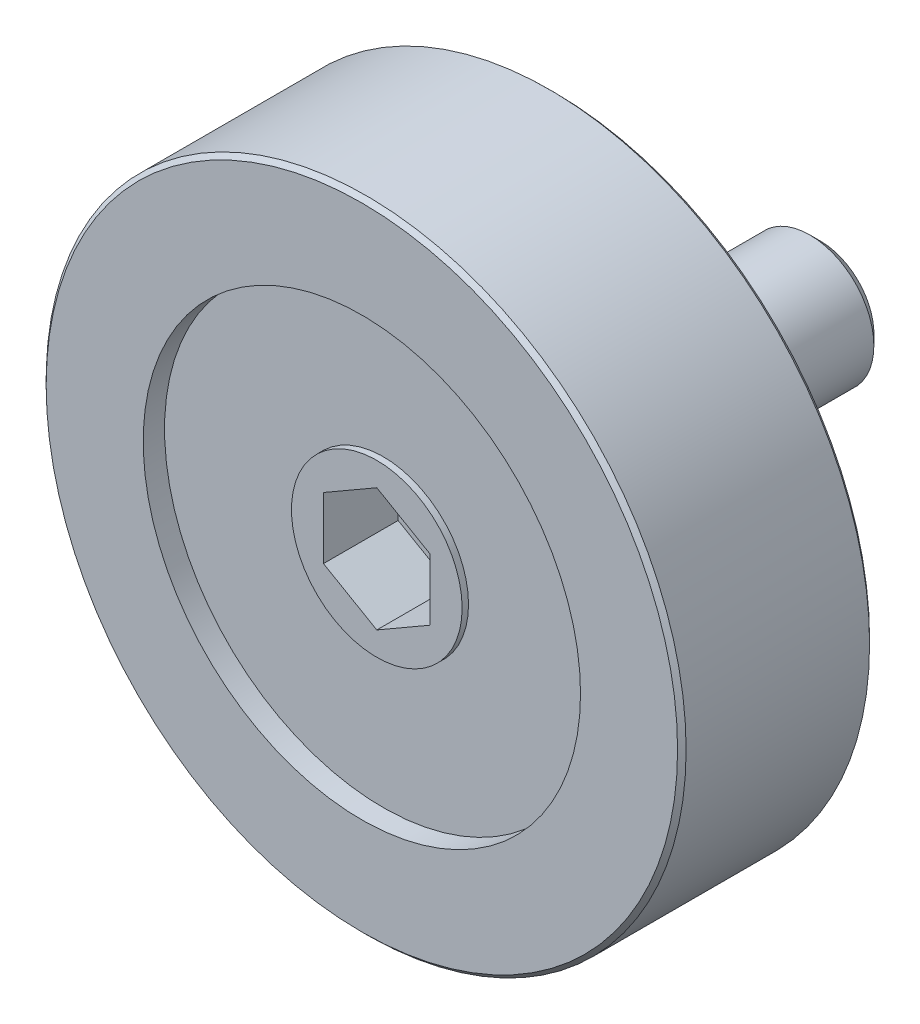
ISO-10303-21;
HEADER;
FILE_DESCRIPTION(('STEP AP214'),'2;1');
FILE_NAME('part.step','',(''),(''),'','','');
FILE_SCHEMA(('AUTOMOTIVE_DESIGN { 1 0 10303 214 1 1 1 1 }'));
ENDSEC;
DATA;
#1=APPLICATION_CONTEXT('core data for automotive mechanical design processes');
#2=APPLICATION_PROTOCOL_DEFINITION('international standard','automotive_design',2000,#1);
#3=PRODUCT_CONTEXT('',#1,'mechanical');
#4=PRODUCT('Part','Part','',(#3));
#5=PRODUCT_RELATED_PRODUCT_CATEGORY('part','',(#4));
#6=PRODUCT_DEFINITION_FORMATION('','',#4);
#7=PRODUCT_DEFINITION_CONTEXT('part definition',#1,'design');
#8=PRODUCT_DEFINITION('design','',#6,#7);
#9=PRODUCT_DEFINITION_SHAPE('','',#8);
#10=(LENGTH_UNIT() NAMED_UNIT(*) SI_UNIT(.MILLI.,.METRE.));
#11=(NAMED_UNIT(*) PLANE_ANGLE_UNIT() SI_UNIT($,.RADIAN.));
#12=(NAMED_UNIT(*) SI_UNIT($,.STERADIAN.) SOLID_ANGLE_UNIT());
#13=UNCERTAINTY_MEASURE_WITH_UNIT(LENGTH_MEASURE(1.E-05),#10,'distance_accuracy_value','');
#14=(GEOMETRIC_REPRESENTATION_CONTEXT(3) GLOBAL_UNCERTAINTY_ASSIGNED_CONTEXT((#13)) GLOBAL_UNIT_ASSIGNED_CONTEXT((#10,
#11,#12)) REPRESENTATION_CONTEXT('',''));
#15=CARTESIAN_POINT('',(0.,0.,0.));
#16=DIRECTION('',(0.,0.,1.));
#17=DIRECTION('',(1.,0.,0.));
#18=AXIS2_PLACEMENT_3D('',#15,#16,#17);
#19=CARTESIAN_POINT('',(0.,0.,0.5));
#20=DIRECTION('',(0.,0.,-1.));
#21=DIRECTION('',(-1.,0.,0.));
#22=AXIS2_PLACEMENT_3D('',#19,#20,#21);
#23=PLANE('',#22);
#24=CARTESIAN_POINT('',(0.,0.,0.5));
#25=DIRECTION('',(0.,0.,-1.));
#26=DIRECTION('',(-1.,0.,0.));
#27=AXIS2_PLACEMENT_3D('',#24,#25,#26);
#28=CIRCLE('',#27,2.35);
#29=CARTESIAN_POINT('',(-2.35,0.,0.5));
#30=VERTEX_POINT('',#29);
#31=EDGE_CURVE('E9',#30,#30,#28,.T.);
#32=ORIENTED_EDGE('',*,*,#31,.F.);
#33=EDGE_LOOP('',(#32));
#34=FACE_BOUND('',#33,.T.);
#35=CARTESIAN_POINT('',(0.,0.,0.5));
#36=DIRECTION('',(0.,0.,-1.));
#37=DIRECTION('',(-1.,0.,0.));
#38=AXIS2_PLACEMENT_3D('',#35,#36,#37);
#39=CIRCLE('',#38,5.1);
#40=CARTESIAN_POINT('',(-5.1,0.,0.5));
#41=VERTEX_POINT('',#40);
#42=EDGE_CURVE('E119',#41,#41,#39,.F.);
#43=ORIENTED_EDGE('',*,*,#42,.F.);
#44=EDGE_LOOP('',(#43));
#45=FACE_BOUND('',#44,.T.);
#46=ADVANCED_FACE('F14',(#34,#45),#23,.T.);
#47=CARTESIAN_POINT('',(0.,0.,5.8));
#48=DIRECTION('',(0.,0.,1.));
#49=DIRECTION('',(1.,0.,0.));
#50=AXIS2_PLACEMENT_3D('',#47,#48,#49);
#51=PLANE('',#50);
#52=DIRECTION('',(-0.866025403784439,0.5,0.));
#53=VECTOR('',#52,1.);
#54=CARTESIAN_POINT('',(2.5,1.44337567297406,5.8));
#55=LINE('',#54,#53);
#56=CARTESIAN_POINT('',(2.5,1.44337567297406,5.8));
#57=VERTEX_POINT('',#56);
#58=CARTESIAN_POINT('',(0.,2.88675134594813,5.8));
#59=VERTEX_POINT('',#58);
#60=EDGE_CURVE('E98',#57,#59,#55,.T.);
#61=ORIENTED_EDGE('',*,*,#60,.T.);
#62=DIRECTION('',(-0.866025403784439,-0.5,0.));
#63=VECTOR('',#62,1.);
#64=CARTESIAN_POINT('',(0.,2.88675134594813,5.8));
#65=LINE('',#64,#63);
#66=CARTESIAN_POINT('',(-2.5,1.44337567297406,5.8));
#67=VERTEX_POINT('',#66);
#68=EDGE_CURVE('E115',#59,#67,#65,.T.);
#69=ORIENTED_EDGE('',*,*,#68,.T.);
#70=DIRECTION('',(0.,-1.,0.));
#71=VECTOR('',#70,1.);
#72=CARTESIAN_POINT('',(-2.5,1.44337567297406,5.8));
#73=LINE('',#72,#71);
#74=CARTESIAN_POINT('',(-2.5,-1.44337567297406,5.8));
#75=VERTEX_POINT('',#74);
#76=EDGE_CURVE('E112',#67,#75,#73,.T.);
#77=ORIENTED_EDGE('',*,*,#76,.T.);
#78=DIRECTION('',(0.866025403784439,-0.5,0.));
#79=VECTOR('',#78,1.);
#80=CARTESIAN_POINT('',(-2.5,-1.44337567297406,5.8));
#81=LINE('',#80,#79);
#82=CARTESIAN_POINT('',(0.,-2.88675134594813,5.8));
#83=VERTEX_POINT('',#82);
#84=EDGE_CURVE('E110',#75,#83,#81,.T.);
#85=ORIENTED_EDGE('',*,*,#84,.T.);
#86=DIRECTION('',(0.866025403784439,0.5,0.));
#87=VECTOR('',#86,1.);
#88=CARTESIAN_POINT('',(0.,-2.88675134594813,5.8));
#89=LINE('',#88,#87);
#90=CARTESIAN_POINT('',(2.5,-1.44337567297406,5.8));
#91=VERTEX_POINT('',#90);
#92=EDGE_CURVE('E79',#83,#91,#89,.T.);
#93=ORIENTED_EDGE('',*,*,#92,.T.);
#94=DIRECTION('',(0.,1.,0.));
#95=VECTOR('',#94,1.);
#96=CARTESIAN_POINT('',(2.5,-1.44337567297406,5.8));
#97=LINE('',#96,#95);
#98=EDGE_CURVE('E106',#91,#57,#97,.T.);
#99=ORIENTED_EDGE('',*,*,#98,.T.);
#100=EDGE_LOOP('',(#61,#69,#77,#85,#93,#99));
#101=FACE_BOUND('',#100,.T.);
#102=ADVANCED_FACE('F174',(#101),#51,.T.);
#103=CARTESIAN_POINT('',(0.,2.88675134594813,5.8));
#104=DIRECTION('',(-0.5,0.866025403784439,0.));
#105=DIRECTION('',(-0.866025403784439,-0.5,0.));
#106=AXIS2_PLACEMENT_3D('',#103,#104,#105);
#107=PLANE('',#106);
#108=DIRECTION('',(-0.866025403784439,-0.5,0.));
#109=VECTOR('',#108,1.);
#110=CARTESIAN_POINT('',(0.,2.88675134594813,9.3));
#111=LINE('',#110,#109);
#112=CARTESIAN_POINT('',(0.,2.88675134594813,9.3));
#113=VERTEX_POINT('',#112);
#114=CARTESIAN_POINT('',(-2.5,1.44337567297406,9.3));
#115=VERTEX_POINT('',#114);
#116=EDGE_CURVE('E103',#113,#115,#111,.T.);
#117=ORIENTED_EDGE('',*,*,#116,.T.);
#118=DIRECTION('',(0.,0.,1.));
#119=VECTOR('',#118,1.);
#120=CARTESIAN_POINT('',(-2.5,1.44337567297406,5.8));
#121=LINE('',#120,#119);
#122=EDGE_CURVE('E31',#67,#115,#121,.T.);
#123=ORIENTED_EDGE('',*,*,#122,.F.);
#124=ORIENTED_EDGE('',*,*,#68,.F.);
#125=DIRECTION('',(0.,0.,1.));
#126=VECTOR('',#125,1.);
#127=CARTESIAN_POINT('',(0.,2.88675134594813,5.8));
#128=LINE('',#127,#126);
#129=EDGE_CURVE('E59',#59,#113,#128,.T.);
#130=ORIENTED_EDGE('',*,*,#129,.T.);
#131=EDGE_LOOP('',(#117,#123,#124,#130));
#132=FACE_BOUND('',#131,.T.);
#133=ADVANCED_FACE('F177',(#132),#107,.F.);
#134=CARTESIAN_POINT('',(-2.5,1.44337567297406,5.8));
#135=DIRECTION('',(-1.,0.,0.));
#136=DIRECTION('',(0.,-1.,0.));
#137=AXIS2_PLACEMENT_3D('',#134,#135,#136);
#138=PLANE('',#137);
#139=DIRECTION('',(0.,-1.,0.));
#140=VECTOR('',#139,1.);
#141=CARTESIAN_POINT('',(-2.5,1.44337567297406,9.3));
#142=LINE('',#141,#140);
#143=CARTESIAN_POINT('',(-2.5,-1.44337567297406,9.3));
#144=VERTEX_POINT('',#143);
#145=EDGE_CURVE('E91',#115,#144,#142,.T.);
#146=ORIENTED_EDGE('',*,*,#145,.T.);
#147=DIRECTION('',(0.,0.,1.));
#148=VECTOR('',#147,1.);
#149=CARTESIAN_POINT('',(-2.5,-1.44337567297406,5.8));
#150=LINE('',#149,#148);
#151=EDGE_CURVE('E83',#75,#144,#150,.T.);
#152=ORIENTED_EDGE('',*,*,#151,.F.);
#153=ORIENTED_EDGE('',*,*,#76,.F.);
#154=ORIENTED_EDGE('',*,*,#122,.T.);
#155=EDGE_LOOP('',(#146,#152,#153,#154));
#156=FACE_BOUND('',#155,.T.);
#157=ADVANCED_FACE('F175',(#156),#138,.F.);
#158=CARTESIAN_POINT('',(-2.5,-1.44337567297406,5.8));
#159=DIRECTION('',(-0.5,-0.866025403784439,0.));
#160=DIRECTION('',(0.866025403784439,-0.5,0.));
#161=AXIS2_PLACEMENT_3D('',#158,#159,#160);
#162=PLANE('',#161);
#163=DIRECTION('',(0.866025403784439,-0.5,0.));
#164=VECTOR('',#163,1.);
#165=CARTESIAN_POINT('',(-2.5,-1.44337567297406,9.3));
#166=LINE('',#165,#164);
#167=CARTESIAN_POINT('',(0.,-2.88675134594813,9.3));
#168=VERTEX_POINT('',#167);
#169=EDGE_CURVE('E87',#144,#168,#166,.T.);
#170=ORIENTED_EDGE('',*,*,#169,.T.);
#171=DIRECTION('',(0.,0.,1.));
#172=VECTOR('',#171,1.);
#173=CARTESIAN_POINT('',(0.,-2.88675134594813,5.8));
#174=LINE('',#173,#172);
#175=EDGE_CURVE('E72',#83,#168,#174,.T.);
#176=ORIENTED_EDGE('',*,*,#175,.F.);
#177=ORIENTED_EDGE('',*,*,#84,.F.);
#178=ORIENTED_EDGE('',*,*,#151,.T.);
#179=EDGE_LOOP('',(#170,#176,#177,#178));
#180=FACE_BOUND('',#179,.T.);
#181=ADVANCED_FACE('F88',(#180),#162,.F.);
#182=CARTESIAN_POINT('',(0.,-2.88675134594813,5.8));
#183=DIRECTION('',(0.5,-0.866025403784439,0.));
#184=DIRECTION('',(0.866025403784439,0.5,0.));
#185=AXIS2_PLACEMENT_3D('',#182,#183,#184);
#186=PLANE('',#185);
#187=DIRECTION('',(0.866025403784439,0.5,0.));
#188=VECTOR('',#187,1.);
#189=CARTESIAN_POINT('',(0.,-2.88675134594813,9.3));
#190=LINE('',#189,#188);
#191=CARTESIAN_POINT('',(2.5,-1.44337567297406,9.3));
#192=VERTEX_POINT('',#191);
#193=EDGE_CURVE('E76',#168,#192,#190,.T.);
#194=ORIENTED_EDGE('',*,*,#193,.T.);
#195=DIRECTION('',(0.,0.,1.));
#196=VECTOR('',#195,1.);
#197=CARTESIAN_POINT('',(2.5,-1.44337567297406,5.8));
#198=LINE('',#197,#196);
#199=EDGE_CURVE('E84',#91,#192,#198,.T.);
#200=ORIENTED_EDGE('',*,*,#199,.F.);
#201=ORIENTED_EDGE('',*,*,#92,.F.);
#202=ORIENTED_EDGE('',*,*,#175,.T.);
#203=EDGE_LOOP('',(#194,#200,#201,#202));
#204=FACE_BOUND('',#203,.T.);
#205=ADVANCED_FACE('F74',(#204),#186,.F.);
#206=CARTESIAN_POINT('',(2.5,-1.44337567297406,5.8));
#207=DIRECTION('',(1.,0.,0.));
#208=DIRECTION('',(0.,0.,-1.));
#209=AXIS2_PLACEMENT_3D('',#206,#207,#208);
#210=PLANE('',#209);
#211=DIRECTION('',(0.,1.,0.));
#212=VECTOR('',#211,1.);
#213=CARTESIAN_POINT('',(2.5,-1.44337567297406,9.3));
#214=LINE('',#213,#212);
#215=CARTESIAN_POINT('',(2.5,1.44337567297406,9.3));
#216=VERTEX_POINT('',#215);
#217=EDGE_CURVE('E96',#192,#216,#214,.T.);
#218=ORIENTED_EDGE('',*,*,#217,.T.);
#219=DIRECTION('',(0.,0.,1.));
#220=VECTOR('',#219,1.);
#221=CARTESIAN_POINT('',(2.5,1.44337567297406,5.8));
#222=LINE('',#221,#220);
#223=EDGE_CURVE('E63',#57,#216,#222,.T.);
#224=ORIENTED_EDGE('',*,*,#223,.F.);
#225=ORIENTED_EDGE('',*,*,#98,.F.);
#226=ORIENTED_EDGE('',*,*,#199,.T.);
#227=EDGE_LOOP('',(#218,#224,#225,#226));
#228=FACE_BOUND('',#227,.T.);
#229=ADVANCED_FACE('F172',(#228),#210,.F.);
#230=CARTESIAN_POINT('',(2.5,1.44337567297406,5.8));
#231=DIRECTION('',(0.5,0.866025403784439,0.));
#232=DIRECTION('',(-0.866025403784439,0.5,0.));
#233=AXIS2_PLACEMENT_3D('',#230,#231,#232);
#234=PLANE('',#233);
#235=DIRECTION('',(-0.866025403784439,0.5,0.));
#236=VECTOR('',#235,1.);
#237=CARTESIAN_POINT('',(2.5,1.44337567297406,9.3));
#238=LINE('',#237,#236);
#239=EDGE_CURVE('E23',#216,#113,#238,.T.);
#240=ORIENTED_EDGE('',*,*,#239,.T.);
#241=ORIENTED_EDGE('',*,*,#129,.F.);
#242=ORIENTED_EDGE('',*,*,#60,.F.);
#243=ORIENTED_EDGE('',*,*,#223,.T.);
#244=EDGE_LOOP('',(#240,#241,#242,#243));
#245=FACE_BOUND('',#244,.T.);
#246=ADVANCED_FACE('F178',(#245),#234,.F.);
#247=CARTESIAN_POINT('',(0.,4.00000000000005,9.3));
#248=DIRECTION('',(0.,0.,1.));
#249=DIRECTION('',(1.,0.,0.));
#250=AXIS2_PLACEMENT_3D('',#247,#248,#249);
#251=PLANE('',#250);
#252=ORIENTED_EDGE('',*,*,#239,.F.);
#253=ORIENTED_EDGE('',*,*,#217,.F.);
#254=ORIENTED_EDGE('',*,*,#193,.F.);
#255=ORIENTED_EDGE('',*,*,#169,.F.);
#256=ORIENTED_EDGE('',*,*,#145,.F.);
#257=ORIENTED_EDGE('',*,*,#116,.F.);
#258=EDGE_LOOP('',(#252,#253,#254,#255,#256,#257));
#259=FACE_BOUND('',#258,.T.);
#260=CARTESIAN_POINT('',(0.,0.,9.3));
#261=DIRECTION('',(0.,0.,1.));
#262=DIRECTION('',(1.,0.,0.));
#263=AXIS2_PLACEMENT_3D('',#260,#261,#262);
#264=CIRCLE('',#263,4.00000000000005);
#265=CARTESIAN_POINT('',(4.00000000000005,0.,9.3));
#266=VERTEX_POINT('',#265);
#267=EDGE_CURVE('E155',#266,#266,#264,.T.);
#268=ORIENTED_EDGE('',*,*,#267,.T.);
#269=EDGE_LOOP('',(#268));
#270=FACE_BOUND('',#269,.T.);
#271=ADVANCED_FACE('F94',(#259,#270),#251,.T.);
#272=CARTESIAN_POINT('',(0.,0.,13.));
#273=DIRECTION('',(0.,0.,1.));
#274=DIRECTION('',(1.,0.,0.));
#275=AXIS2_PLACEMENT_3D('',#272,#273,#274);
#276=CYLINDRICAL_SURFACE('',#275,4.00000000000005);
#277=CARTESIAN_POINT('',(0.,0.,9.));
#278=DIRECTION('',(0.,0.,1.));
#279=DIRECTION('',(1.,0.,0.));
#280=AXIS2_PLACEMENT_3D('',#277,#278,#279);
#281=CIRCLE('',#280,4.00000000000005);
#282=CARTESIAN_POINT('',(4.00000000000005,0.,9.));
#283=VERTEX_POINT('',#282);
#284=EDGE_CURVE('E158',#283,#283,#281,.T.);
#285=ORIENTED_EDGE('',*,*,#284,.T.);
#286=EDGE_LOOP('',(#285));
#287=FACE_BOUND('',#286,.T.);
#288=ORIENTED_EDGE('',*,*,#267,.F.);
#289=EDGE_LOOP('',(#288));
#290=FACE_BOUND('',#289,.T.);
#291=ADVANCED_FACE('F186',(#287,#290),#276,.T.);
#292=CARTESIAN_POINT('',(0.,10.25,9.));
#293=DIRECTION('',(0.,0.,1.));
#294=DIRECTION('',(1.,0.,0.));
#295=AXIS2_PLACEMENT_3D('',#292,#293,#294);
#296=PLANE('',#295);
#297=CARTESIAN_POINT('',(0.,0.,9.));
#298=DIRECTION('',(0.,0.,1.));
#299=DIRECTION('',(1.,0.,0.));
#300=AXIS2_PLACEMENT_3D('',#297,#298,#299);
#301=CIRCLE('',#300,10.25);
#302=CARTESIAN_POINT('',(10.25,0.,9.));
#303=VERTEX_POINT('',#302);
#304=EDGE_CURVE('E161',#303,#303,#301,.T.);
#305=ORIENTED_EDGE('',*,*,#304,.T.);
#306=EDGE_LOOP('',(#305));
#307=FACE_BOUND('',#306,.T.);
#308=ORIENTED_EDGE('',*,*,#284,.F.);
#309=EDGE_LOOP('',(#308));
#310=FACE_BOUND('',#309,.T.);
#311=ADVANCED_FACE('F250',(#307,#310),#296,.T.);
#312=CARTESIAN_POINT('',(0.,0.,13.));
#313=DIRECTION('',(0.,0.,1.));
#314=DIRECTION('',(1.,0.,0.));
#315=AXIS2_PLACEMENT_3D('',#312,#313,#314);
#316=CYLINDRICAL_SURFACE('',#315,10.25);
#317=CARTESIAN_POINT('',(0.,0.,10.));
#318=DIRECTION('',(0.,0.,1.));
#319=DIRECTION('',(1.,0.,0.));
#320=AXIS2_PLACEMENT_3D('',#317,#318,#319);
#321=CIRCLE('',#320,10.25);
#322=CARTESIAN_POINT('',(10.25,0.,10.));
#323=VERTEX_POINT('',#322);
#324=EDGE_CURVE('E164',#323,#323,#321,.T.);
#325=ORIENTED_EDGE('',*,*,#324,.T.);
#326=EDGE_LOOP('',(#325));
#327=FACE_BOUND('',#326,.T.);
#328=ORIENTED_EDGE('',*,*,#304,.F.);
#329=EDGE_LOOP('',(#328));
#330=FACE_BOUND('',#329,.T.);
#331=ADVANCED_FACE('F261',(#327,#330),#316,.F.);
#332=CARTESIAN_POINT('',(0.,14.8,10.));
#333=DIRECTION('',(0.,0.,1.));
#334=DIRECTION('',(1.,0.,0.));
#335=AXIS2_PLACEMENT_3D('',#332,#333,#334);
#336=PLANE('',#335);
#337=CARTESIAN_POINT('',(0.,0.,9.99999999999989));
#338=DIRECTION('',(0.,0.,1.));
#339=DIRECTION('',(1.,0.,0.));
#340=AXIS2_PLACEMENT_3D('',#337,#338,#339);
#341=CIRCLE('',#340,14.8);
#342=CARTESIAN_POINT('',(14.8,0.,9.99999999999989));
#343=VERTEX_POINT('',#342);
#344=EDGE_CURVE('E121',#343,#343,#341,.T.);
#345=ORIENTED_EDGE('',*,*,#344,.T.);
#346=EDGE_LOOP('',(#345));
#347=FACE_BOUND('',#346,.T.);
#348=ORIENTED_EDGE('',*,*,#324,.F.);
#349=EDGE_LOOP('',(#348));
#350=FACE_BOUND('',#349,.T.);
#351=ADVANCED_FACE('F271',(#347,#350),#336,.T.);
#352=CARTESIAN_POINT('',(0.,0.,9.99999999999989));
#353=DIRECTION('',(0.,0.,-1.));
#354=DIRECTION('',(-1.,0.,0.));
#355=AXIS2_PLACEMENT_3D('',#352,#353,#354);
#356=CONICAL_SURFACE('',#355,14.8,0.785398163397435);
#357=CARTESIAN_POINT('',(0.,0.,9.79999999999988));
#358=DIRECTION('',(0.,0.,1.));
#359=DIRECTION('',(1.,0.,0.));
#360=AXIS2_PLACEMENT_3D('',#357,#358,#359);
#361=CIRCLE('',#360,15.);
#362=CARTESIAN_POINT('',(15.,0.,9.79999999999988));
#363=VERTEX_POINT('',#362);
#364=EDGE_CURVE('E126',#363,#363,#361,.T.);
#365=ORIENTED_EDGE('',*,*,#364,.T.);
#366=EDGE_LOOP('',(#365));
#367=FACE_BOUND('',#366,.T.);
#368=ORIENTED_EDGE('',*,*,#344,.F.);
#369=EDGE_LOOP('',(#368));
#370=FACE_BOUND('',#369,.T.);
#371=ADVANCED_FACE('F280',(#367,#370),#356,.T.);
#372=CARTESIAN_POINT('',(0.,0.,13.));
#373=DIRECTION('',(0.,0.,1.));
#374=DIRECTION('',(1.,0.,0.));
#375=AXIS2_PLACEMENT_3D('',#372,#373,#374);
#376=CYLINDRICAL_SURFACE('',#375,15.);
#377=CARTESIAN_POINT('',(0.,0.,1.2));
#378=DIRECTION('',(0.,0.,1.));
#379=DIRECTION('',(1.,0.,0.));
#380=AXIS2_PLACEMENT_3D('',#377,#378,#379);
#381=CIRCLE('',#380,15.);
#382=CARTESIAN_POINT('',(15.,0.,1.2));
#383=VERTEX_POINT('',#382);
#384=EDGE_CURVE('E140',#383,#383,#381,.T.);
#385=ORIENTED_EDGE('',*,*,#384,.T.);
#386=EDGE_LOOP('',(#385));
#387=FACE_BOUND('',#386,.T.);
#388=ORIENTED_EDGE('',*,*,#364,.F.);
#389=EDGE_LOOP('',(#388));
#390=FACE_BOUND('',#389,.T.);
#391=ADVANCED_FACE('F290',(#387,#390),#376,.T.);
#392=CARTESIAN_POINT('',(0.,0.,1.2));
#393=DIRECTION('',(0.,0.,1.));
#394=DIRECTION('',(1.,0.,0.));
#395=AXIS2_PLACEMENT_3D('',#392,#393,#394);
#396=CONICAL_SURFACE('',#395,15.,0.785398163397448);
#397=CARTESIAN_POINT('',(0.,0.,1.));
#398=DIRECTION('',(0.,0.,1.));
#399=DIRECTION('',(1.,0.,0.));
#400=AXIS2_PLACEMENT_3D('',#397,#398,#399);
#401=CIRCLE('',#400,14.8);
#402=CARTESIAN_POINT('',(14.8,0.,1.));
#403=VERTEX_POINT('',#402);
#404=EDGE_CURVE('E143',#403,#403,#401,.T.);
#405=ORIENTED_EDGE('',*,*,#404,.T.);
#406=EDGE_LOOP('',(#405));
#407=FACE_BOUND('',#406,.T.);
#408=ORIENTED_EDGE('',*,*,#384,.F.);
#409=EDGE_LOOP('',(#408));
#410=FACE_BOUND('',#409,.T.);
#411=ADVANCED_FACE('F300',(#407,#410),#396,.T.);
#412=CARTESIAN_POINT('',(0.,14.8,1.));
#413=DIRECTION('',(0.,0.,-1.));
#414=DIRECTION('',(-1.,0.,0.));
#415=AXIS2_PLACEMENT_3D('',#412,#413,#414);
#416=PLANE('',#415);
#417=CARTESIAN_POINT('',(0.,0.,1.));
#418=DIRECTION('',(0.,0.,1.));
#419=DIRECTION('',(1.,0.,0.));
#420=AXIS2_PLACEMENT_3D('',#417,#418,#419);
#421=CIRCLE('',#420,10.25);
#422=CARTESIAN_POINT('',(10.25,0.,1.));
#423=VERTEX_POINT('',#422);
#424=EDGE_CURVE('E146',#423,#423,#421,.T.);
#425=ORIENTED_EDGE('',*,*,#424,.T.);
#426=EDGE_LOOP('',(#425));
#427=FACE_BOUND('',#426,.T.);
#428=ORIENTED_EDGE('',*,*,#404,.F.);
#429=EDGE_LOOP('',(#428));
#430=FACE_BOUND('',#429,.T.);
#431=ADVANCED_FACE('F310',(#427,#430),#416,.T.);
#432=CARTESIAN_POINT('',(0.,0.,13.));
#433=DIRECTION('',(0.,0.,1.));
#434=DIRECTION('',(1.,0.,0.));
#435=AXIS2_PLACEMENT_3D('',#432,#433,#434);
#436=CYLINDRICAL_SURFACE('',#435,10.25);
#437=CARTESIAN_POINT('',(0.,0.,2.));
#438=DIRECTION('',(0.,0.,1.));
#439=DIRECTION('',(1.,0.,0.));
#440=AXIS2_PLACEMENT_3D('',#437,#438,#439);
#441=CIRCLE('',#440,10.25);
#442=CARTESIAN_POINT('',(10.25,0.,2.));
#443=VERTEX_POINT('',#442);
#444=EDGE_CURVE('E149',#443,#443,#441,.T.);
#445=ORIENTED_EDGE('',*,*,#444,.T.);
#446=EDGE_LOOP('',(#445));
#447=FACE_BOUND('',#446,.T.);
#448=ORIENTED_EDGE('',*,*,#424,.F.);
#449=EDGE_LOOP('',(#448));
#450=FACE_BOUND('',#449,.T.);
#451=ADVANCED_FACE('F320',(#447,#450),#436,.F.);
#452=CARTESIAN_POINT('',(0.,5.1,2.));
#453=DIRECTION('',(0.,0.,-1.));
#454=DIRECTION('',(-1.,0.,0.));
#455=AXIS2_PLACEMENT_3D('',#452,#453,#454);
#456=PLANE('',#455);
#457=CARTESIAN_POINT('',(0.,0.,2.));
#458=DIRECTION('',(0.,0.,1.));
#459=DIRECTION('',(1.,0.,0.));
#460=AXIS2_PLACEMENT_3D('',#457,#458,#459);
#461=CIRCLE('',#460,5.1);
#462=CARTESIAN_POINT('',(5.1,0.,2.));
#463=VERTEX_POINT('',#462);
#464=EDGE_CURVE('E152',#463,#463,#461,.T.);
#465=ORIENTED_EDGE('',*,*,#464,.T.);
#466=EDGE_LOOP('',(#465));
#467=FACE_BOUND('',#466,.T.);
#468=ORIENTED_EDGE('',*,*,#444,.F.);
#469=EDGE_LOOP('',(#468));
#470=FACE_BOUND('',#469,.T.);
#471=ADVANCED_FACE('F330',(#467,#470),#456,.T.);
#472=CARTESIAN_POINT('',(0.,0.,13.));
#473=DIRECTION('',(0.,0.,1.));
#474=DIRECTION('',(1.,0.,0.));
#475=AXIS2_PLACEMENT_3D('',#472,#473,#474);
#476=CYLINDRICAL_SURFACE('',#475,5.1);
#477=ORIENTED_EDGE('',*,*,#42,.T.);
#478=EDGE_LOOP('',(#477));
#479=FACE_BOUND('',#478,.T.);
#480=ORIENTED_EDGE('',*,*,#464,.F.);
#481=EDGE_LOOP('',(#480));
#482=FACE_BOUND('',#481,.T.);
#483=ADVANCED_FACE('F16',(#479,#482),#476,.T.);
#484=CARTESIAN_POINT('',(0.,0.,13.5));
#485=DIRECTION('',(0.,0.,1.));
#486=DIRECTION('',(1.,0.,0.));
#487=AXIS2_PLACEMENT_3D('',#484,#485,#486);
#488=CYLINDRICAL_SURFACE('',#487,2.35);
#489=CARTESIAN_POINT('',(0.,0.,-1.5));
#490=DIRECTION('',(0.,0.,1.));
#491=DIRECTION('',(1.,0.,0.));
#492=AXIS2_PLACEMENT_3D('',#489,#490,#491);
#493=CIRCLE('',#492,2.35);
#494=CARTESIAN_POINT('',(2.35,0.,-1.5));
#495=VERTEX_POINT('',#494);
#496=EDGE_CURVE('E134',#495,#495,#493,.T.);
#497=ORIENTED_EDGE('',*,*,#496,.T.);
#498=EDGE_LOOP('',(#497));
#499=FACE_BOUND('',#498,.T.);
#500=ORIENTED_EDGE('',*,*,#31,.T.);
#501=EDGE_LOOP('',(#500));
#502=FACE_BOUND('',#501,.T.);
#503=ADVANCED_FACE('F349',(#499,#502),#488,.T.);
#504=CARTESIAN_POINT('',(0.,2.35,-1.5));
#505=DIRECTION('',(0.,0.,1.));
#506=DIRECTION('',(1.,0.,0.));
#507=AXIS2_PLACEMENT_3D('',#504,#505,#506);
#508=PLANE('',#507);
#509=CARTESIAN_POINT('',(0.,0.,-1.5));
#510=DIRECTION('',(0.,0.,1.));
#511=DIRECTION('',(1.,0.,0.));
#512=AXIS2_PLACEMENT_3D('',#509,#510,#511);
#513=CIRCLE('',#512,3.);
#514=CARTESIAN_POINT('',(3.,0.,-1.5));
#515=VERTEX_POINT('',#514);
#516=EDGE_CURVE('E404',#515,#515,#513,.T.);
#517=ORIENTED_EDGE('',*,*,#516,.T.);
#518=EDGE_LOOP('',(#517));
#519=FACE_BOUND('',#518,.T.);
#520=ORIENTED_EDGE('',*,*,#496,.F.);
#521=EDGE_LOOP('',(#520));
#522=FACE_BOUND('',#521,.T.);
#523=ADVANCED_FACE('F356',(#519,#522),#508,.T.);
#524=CARTESIAN_POINT('',(0.,0.,13.5));
#525=DIRECTION('',(0.,0.,1.));
#526=DIRECTION('',(1.,0.,0.));
#527=AXIS2_PLACEMENT_3D('',#524,#525,#526);
#528=CYLINDRICAL_SURFACE('',#527,3.);
#529=CARTESIAN_POINT('',(0.,0.,-11.));
#530=DIRECTION('',(0.,0.,-1.));
#531=DIRECTION('',(-1.,0.,0.));
#532=AXIS2_PLACEMENT_3D('',#529,#530,#531);
#533=CIRCLE('',#532,3.);
#534=CARTESIAN_POINT('',(-3.,0.,-11.));
#535=VERTEX_POINT('',#534);
#536=EDGE_CURVE('E122',#535,#535,#533,.F.);
#537=ORIENTED_EDGE('',*,*,#536,.T.);
#538=EDGE_LOOP('',(#537));
#539=FACE_BOUND('',#538,.T.);
#540=ORIENTED_EDGE('',*,*,#516,.F.);
#541=EDGE_LOOP('',(#540));
#542=FACE_BOUND('',#541,.T.);
#543=ADVANCED_FACE('F366',(#539,#542),#528,.T.);
#544=CARTESIAN_POINT('',(0.,0.,-11.5));
#545=DIRECTION('',(0.,0.,-1.));
#546=DIRECTION('',(-1.,0.,0.));
#547=AXIS2_PLACEMENT_3D('',#544,#545,#546);
#548=PLANE('',#547);
#549=CARTESIAN_POINT('',(0.,0.,-11.5));
#550=DIRECTION('',(0.,0.,-1.));
#551=DIRECTION('',(-1.,0.,0.));
#552=AXIS2_PLACEMENT_3D('',#549,#550,#551);
#553=CIRCLE('',#552,2.5);
#554=CARTESIAN_POINT('',(-2.5,0.,-11.5));
#555=VERTEX_POINT('',#554);
#556=EDGE_CURVE('E129',#555,#555,#553,.T.);
#557=ORIENTED_EDGE('',*,*,#556,.T.);
#558=EDGE_LOOP('',(#557));
#559=FACE_BOUND('',#558,.T.);
#560=ADVANCED_FACE('F376',(#559),#548,.T.);
#561=CARTESIAN_POINT('',(0.,0.,-11.5));
#562=DIRECTION('',(0.,0.,1.));
#563=DIRECTION('',(1.,0.,0.));
#564=AXIS2_PLACEMENT_3D('',#561,#562,#563);
#565=CONICAL_SURFACE('',#564,2.5,0.785398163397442);
#566=ORIENTED_EDGE('',*,*,#536,.F.);
#567=EDGE_LOOP('',(#566));
#568=FACE_BOUND('',#567,.T.);
#569=ORIENTED_EDGE('',*,*,#556,.F.);
#570=EDGE_LOOP('',(#569));
#571=FACE_BOUND('',#570,.T.);
#572=ADVANCED_FACE('F198',(#568,#571),#565,.T.);
#573=CLOSED_SHELL('',(#46,#102,#133,#157,#181,#205,#229,#246,#271,#291,#311,#331,#351,#371,#391,
#411,#431,#451,#471,#483,#503,#523,#543,#560,#572));
#574=MANIFOLD_SOLID_BREP('B1',#573);
#575=ADVANCED_BREP_SHAPE_REPRESENTATION('',(#18,#574),#14);
#576=SHAPE_DEFINITION_REPRESENTATION(#9,#575);
ENDSEC;
END-ISO-10303-21;
